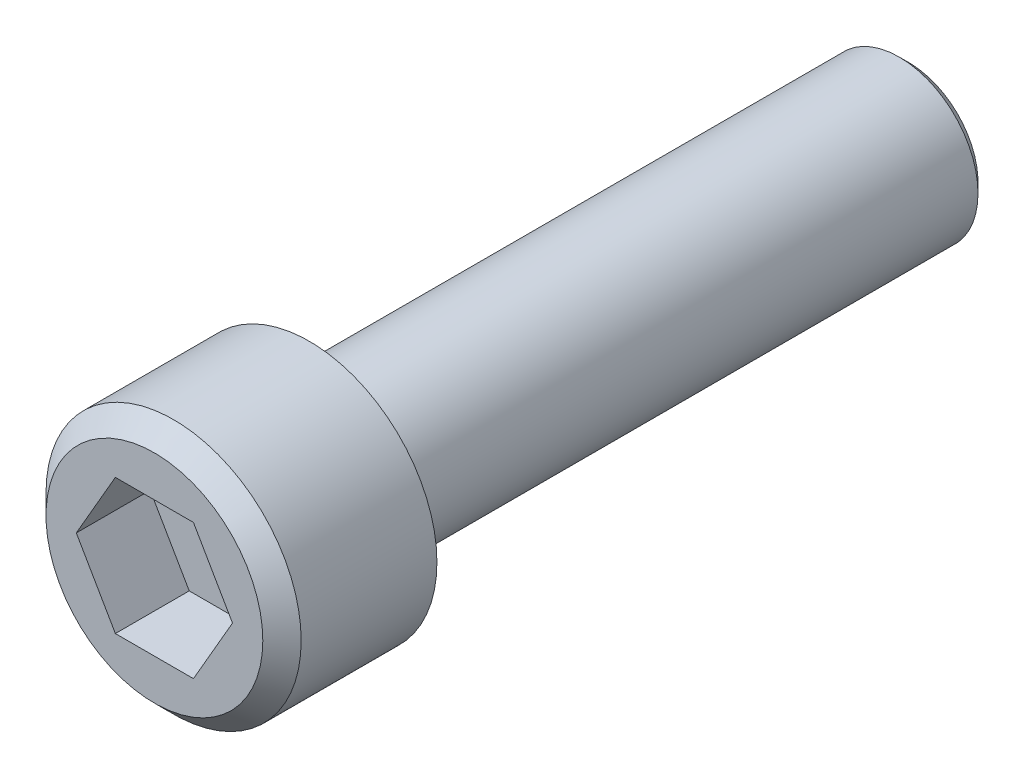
ISO-10303-21;
HEADER;
FILE_DESCRIPTION(('STEP AP214'),'2;1');
FILE_NAME('part.step','',(''),(''),'','','');
FILE_SCHEMA(('AUTOMOTIVE_DESIGN { 1 0 10303 214 1 1 1 1 }'));
ENDSEC;
DATA;
#1=APPLICATION_CONTEXT('core data for automotive mechanical design processes');
#2=APPLICATION_PROTOCOL_DEFINITION('international standard','automotive_design',2000,#1);
#3=PRODUCT_CONTEXT('',#1,'mechanical');
#4=PRODUCT('Part','Part','',(#3));
#5=PRODUCT_RELATED_PRODUCT_CATEGORY('part','',(#4));
#6=PRODUCT_DEFINITION_FORMATION('','',#4);
#7=PRODUCT_DEFINITION_CONTEXT('part definition',#1,'design');
#8=PRODUCT_DEFINITION('design','',#6,#7);
#9=PRODUCT_DEFINITION_SHAPE('','',#8);
#10=(LENGTH_UNIT() NAMED_UNIT(*) SI_UNIT(.MILLI.,.METRE.));
#11=(NAMED_UNIT(*) PLANE_ANGLE_UNIT() SI_UNIT($,.RADIAN.));
#12=(NAMED_UNIT(*) SI_UNIT($,.STERADIAN.) SOLID_ANGLE_UNIT());
#13=UNCERTAINTY_MEASURE_WITH_UNIT(LENGTH_MEASURE(1.E-05),#10,'distance_accuracy_value','');
#14=(GEOMETRIC_REPRESENTATION_CONTEXT(3) GLOBAL_UNCERTAINTY_ASSIGNED_CONTEXT((#13)) GLOBAL_UNIT_ASSIGNED_CONTEXT((#10,
#11,#12)) REPRESENTATION_CONTEXT('',''));
#15=CARTESIAN_POINT('',(0.,0.,0.));
#16=DIRECTION('',(0.,0.,1.));
#17=DIRECTION('',(1.,0.,0.));
#18=AXIS2_PLACEMENT_3D('',#15,#16,#17);
#19=CARTESIAN_POINT('',(8.88178419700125E-13,0.,-4.102099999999));
#20=DIRECTION('',(0.,0.,1.));
#21=DIRECTION('',(1.,0.,0.));
#22=AXIS2_PLACEMENT_3D('',#19,#20,#21);
#23=PLANE('',#22);
#24=CARTESIAN_POINT('',(8.88178419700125E-13,0.,-4.102099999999));
#25=DIRECTION('',(0.,0.,1.));
#26=DIRECTION('',(1.,0.,0.));
#27=AXIS2_PLACEMENT_3D('',#24,#25,#26);
#28=CIRCLE('',#27,3.3782);
#29=CARTESIAN_POINT('',(3.37820000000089,0.,-4.102099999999));
#30=VERTEX_POINT('',#29);
#31=EDGE_CURVE('E142',#30,#30,#28,.T.);
#32=ORIENTED_EDGE('',*,*,#31,.F.);
#33=EDGE_LOOP('',(#32));
#34=FACE_BOUND('',#33,.T.);
#35=CARTESIAN_POINT('',(8.88178419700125E-13,0.,-4.102099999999));
#36=DIRECTION('',(0.,0.,1.));
#37=DIRECTION('',(1.,0.,0.));
#38=AXIS2_PLACEMENT_3D('',#35,#36,#37);
#39=CIRCLE('',#38,2.0828);
#40=CARTESIAN_POINT('',(2.08280000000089,0.,-4.102099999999));
#41=VERTEX_POINT('',#40);
#42=EDGE_CURVE('E150',#41,#41,#39,.F.);
#43=ORIENTED_EDGE('',*,*,#42,.F.);
#44=EDGE_LOOP('',(#43));
#45=FACE_BOUND('',#44,.T.);
#46=ADVANCED_FACE('F40',(#34,#45),#23,.F.);
#47=CARTESIAN_POINT('',(8.88178419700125E-13,0.,-4.102099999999));
#48=DIRECTION('',(0.,0.,1.));
#49=DIRECTION('',(1.,0.,0.));
#50=AXIS2_PLACEMENT_3D('',#47,#48,#49);
#51=CYLINDRICAL_SURFACE('',#50,3.3782);
#52=CARTESIAN_POINT('',(1.77635683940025E-12,0.,-0.507999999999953));
#53=DIRECTION('',(0.,0.,1.));
#54=DIRECTION('',(1.,0.,0.));
#55=AXIS2_PLACEMENT_3D('',#52,#53,#54);
#56=CIRCLE('',#55,3.3782);
#57=CARTESIAN_POINT('',(3.37820000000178,0.,-0.507999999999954));
#58=VERTEX_POINT('',#57);
#59=EDGE_CURVE('E11',#58,#58,#56,.F.);
#60=ORIENTED_EDGE('',*,*,#59,.T.);
#61=EDGE_LOOP('',(#60));
#62=FACE_BOUND('',#61,.T.);
#63=ORIENTED_EDGE('',*,*,#31,.T.);
#64=EDGE_LOOP('',(#63));
#65=FACE_BOUND('',#64,.T.);
#66=ADVANCED_FACE('F173',(#62,#65),#51,.T.);
#67=CARTESIAN_POINT('',(0.,0.,0.));
#68=DIRECTION('',(0.,0.,1.));
#69=DIRECTION('',(1.,0.,0.));
#70=AXIS2_PLACEMENT_3D('',#67,#68,#69);
#71=PLANE('',#70);
#72=CARTESIAN_POINT('',(0.,0.,0.));
#73=DIRECTION('',(0.,0.,1.));
#74=DIRECTION('',(1.,0.,0.));
#75=AXIS2_PLACEMENT_3D('',#72,#73,#74);
#76=CIRCLE('',#75,2.8702);
#77=CARTESIAN_POINT('',(2.8702,0.,0.));
#78=VERTEX_POINT('',#77);
#79=EDGE_CURVE('E48',#78,#78,#76,.T.);
#80=ORIENTED_EDGE('',*,*,#79,.T.);
#81=EDGE_LOOP('',(#80));
#82=FACE_BOUND('',#81,.T.);
#83=DIRECTION('',(0.5,0.866025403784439,0.));
#84=VECTOR('',#83,1.);
#85=CARTESIAN_POINT('',(1.03386112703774,-1.79070000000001,0.));
#86=LINE('',#85,#84);
#87=CARTESIAN_POINT('',(1.03386112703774,-1.79070000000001,0.));
#88=VERTEX_POINT('',#87);
#89=CARTESIAN_POINT('',(2.06772225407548,0.,0.));
#90=VERTEX_POINT('',#89);
#91=EDGE_CURVE('E55',#88,#90,#86,.T.);
#92=ORIENTED_EDGE('',*,*,#91,.F.);
#93=DIRECTION('',(1.,0.,0.));
#94=VECTOR('',#93,1.);
#95=CARTESIAN_POINT('',(-1.03386112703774,-1.79070000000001,0.));
#96=LINE('',#95,#94);
#97=CARTESIAN_POINT('',(-1.03386112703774,-1.79070000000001,0.));
#98=VERTEX_POINT('',#97);
#99=EDGE_CURVE('E138',#98,#88,#96,.T.);
#100=ORIENTED_EDGE('',*,*,#99,.F.);
#101=DIRECTION('',(0.5,-0.866025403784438,0.));
#102=VECTOR('',#101,1.);
#103=CARTESIAN_POINT('',(-2.06772225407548,0.,-8.88178419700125E-13));
#104=LINE('',#103,#102);
#105=CARTESIAN_POINT('',(-2.06772225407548,0.,-8.88178419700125E-13));
#106=VERTEX_POINT('',#105);
#107=EDGE_CURVE('E136',#106,#98,#104,.T.);
#108=ORIENTED_EDGE('',*,*,#107,.F.);
#109=DIRECTION('',(-0.5,-0.866025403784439,0.));
#110=VECTOR('',#109,1.);
#111=CARTESIAN_POINT('',(-1.03386112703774,1.79070000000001,0.));
#112=LINE('',#111,#110);
#113=CARTESIAN_POINT('',(-1.03386112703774,1.79070000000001,0.));
#114=VERTEX_POINT('',#113);
#115=EDGE_CURVE('E103',#114,#106,#112,.T.);
#116=ORIENTED_EDGE('',*,*,#115,.F.);
#117=DIRECTION('',(-1.,0.,0.));
#118=VECTOR('',#117,1.);
#119=CARTESIAN_POINT('',(1.03386112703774,1.79070000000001,0.));
#120=LINE('',#119,#118);
#121=CARTESIAN_POINT('',(1.03386112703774,1.79070000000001,0.));
#122=VERTEX_POINT('',#121);
#123=EDGE_CURVE('E132',#122,#114,#120,.T.);
#124=ORIENTED_EDGE('',*,*,#123,.F.);
#125=DIRECTION('',(-0.5,0.866025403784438,0.));
#126=VECTOR('',#125,1.);
#127=CARTESIAN_POINT('',(2.06772225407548,0.,0.));
#128=LINE('',#127,#126);
#129=EDGE_CURVE('E129',#90,#122,#128,.T.);
#130=ORIENTED_EDGE('',*,*,#129,.F.);
#131=EDGE_LOOP('',(#92,#100,#108,#116,#124,#130));
#132=FACE_BOUND('',#131,.T.);
#133=ADVANCED_FACE('F161',(#82,#132),#71,.T.);
#134=CARTESIAN_POINT('',(1.77635683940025E-12,-1.66533453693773E-13,-19.9770999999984));
#135=DIRECTION('',(0.,0.,1.));
#136=DIRECTION('',(1.,0.,0.));
#137=AXIS2_PLACEMENT_3D('',#134,#135,#136);
#138=CYLINDRICAL_SURFACE('',#137,2.0828);
#139=CARTESIAN_POINT('',(0.,-1.38777878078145E-13,-19.7231000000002));
#140=DIRECTION('',(0.,0.,-1.));
#141=DIRECTION('',(-1.,0.,0.));
#142=AXIS2_PLACEMENT_3D('',#139,#140,#141);
#143=CIRCLE('',#142,2.0828);
#144=CARTESIAN_POINT('',(-2.0828,-1.38819051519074E-13,-19.7231000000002));
#145=VERTEX_POINT('',#144);
#146=EDGE_CURVE('E156',#145,#145,#143,.F.);
#147=ORIENTED_EDGE('',*,*,#146,.T.);
#148=EDGE_LOOP('',(#147));
#149=FACE_BOUND('',#148,.T.);
#150=ORIENTED_EDGE('',*,*,#42,.T.);
#151=EDGE_LOOP('',(#150));
#152=FACE_BOUND('',#151,.T.);
#153=ADVANCED_FACE('F185',(#149,#152),#138,.T.);
#154=CARTESIAN_POINT('',(1.77635683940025E-12,-1.66533453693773E-13,-19.9770999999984));
#155=DIRECTION('',(0.,0.,-1.));
#156=DIRECTION('',(-1.,0.,0.));
#157=AXIS2_PLACEMENT_3D('',#154,#155,#156);
#158=PLANE('',#157);
#159=CARTESIAN_POINT('',(1.77635683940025E-12,-1.66533453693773E-13,-19.9770999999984));
#160=DIRECTION('',(0.,0.,-1.));
#161=DIRECTION('',(-1.,0.,0.));
#162=AXIS2_PLACEMENT_3D('',#159,#160,#161);
#163=CIRCLE('',#162,1.8288);
#164=CARTESIAN_POINT('',(-1.82879999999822,-1.6656960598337E-13,-19.9770999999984));
#165=VERTEX_POINT('',#164);
#166=EDGE_CURVE('E153',#165,#165,#163,.T.);
#167=ORIENTED_EDGE('',*,*,#166,.T.);
#168=EDGE_LOOP('',(#167));
#169=FACE_BOUND('',#168,.T.);
#170=ADVANCED_FACE('F191',(#169),#158,.T.);
#171=CARTESIAN_POINT('',(1.03386112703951,-1.79070000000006,-1.9557999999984));
#172=DIRECTION('',(0.866025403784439,-0.5,0.));
#173=DIRECTION('',(0.5,0.866025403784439,0.));
#174=AXIS2_PLACEMENT_3D('',#171,#172,#173);
#175=PLANE('',#174);
#176=ORIENTED_EDGE('',*,*,#91,.T.);
#177=DIRECTION('',(0.,0.,1.));
#178=VECTOR('',#177,1.);
#179=CARTESIAN_POINT('',(2.06772225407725,0.,-1.95580000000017));
#180=LINE('',#179,#178);
#181=CARTESIAN_POINT('',(2.06772225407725,0.,-1.95580000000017));
#182=VERTEX_POINT('',#181);
#183=EDGE_CURVE('E85',#182,#90,#180,.T.);
#184=ORIENTED_EDGE('',*,*,#183,.F.);
#185=DIRECTION('',(0.5,0.866025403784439,0.));
#186=VECTOR('',#185,1.);
#187=CARTESIAN_POINT('',(1.03386112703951,-1.79070000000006,-1.9557999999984));
#188=LINE('',#187,#186);
#189=CARTESIAN_POINT('',(1.03386112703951,-1.79070000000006,-1.9557999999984));
#190=VERTEX_POINT('',#189);
#191=EDGE_CURVE('E140',#190,#182,#188,.T.);
#192=ORIENTED_EDGE('',*,*,#191,.F.);
#193=DIRECTION('',(0.,0.,1.));
#194=VECTOR('',#193,1.);
#195=CARTESIAN_POINT('',(1.03386112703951,-1.79070000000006,-1.9557999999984));
#196=LINE('',#195,#194);
#197=EDGE_CURVE('E63',#190,#88,#196,.T.);
#198=ORIENTED_EDGE('',*,*,#197,.T.);
#199=EDGE_LOOP('',(#176,#184,#192,#198));
#200=FACE_BOUND('',#199,.T.);
#201=ADVANCED_FACE('F196',(#200),#175,.F.);
#202=CARTESIAN_POINT('',(-1.03386112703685,-1.79070000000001,-1.95580000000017));
#203=DIRECTION('',(0.,-1.,0.));
#204=DIRECTION('',(1.,0.,0.));
#205=AXIS2_PLACEMENT_3D('',#202,#203,#204);
#206=PLANE('',#205);
#207=ORIENTED_EDGE('',*,*,#99,.T.);
#208=ORIENTED_EDGE('',*,*,#197,.F.);
#209=DIRECTION('',(1.,0.,0.));
#210=VECTOR('',#209,1.);
#211=CARTESIAN_POINT('',(-1.03386112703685,-1.79070000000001,-1.95580000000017));
#212=LINE('',#211,#210);
#213=CARTESIAN_POINT('',(-1.03386112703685,-1.79070000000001,-1.95580000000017));
#214=VERTEX_POINT('',#213);
#215=EDGE_CURVE('E115',#214,#190,#212,.T.);
#216=ORIENTED_EDGE('',*,*,#215,.F.);
#217=DIRECTION('',(0.,0.,1.));
#218=VECTOR('',#217,1.);
#219=CARTESIAN_POINT('',(-1.03386112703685,-1.79070000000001,-1.95580000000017));
#220=LINE('',#219,#218);
#221=EDGE_CURVE('E107',#214,#98,#220,.T.);
#222=ORIENTED_EDGE('',*,*,#221,.T.);
#223=EDGE_LOOP('',(#207,#208,#216,#222));
#224=FACE_BOUND('',#223,.T.);
#225=ADVANCED_FACE('F206',(#224),#206,.F.);
#226=CARTESIAN_POINT('',(-2.06772225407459,0.,-1.95580000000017));
#227=DIRECTION('',(-0.866025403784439,-0.5,0.));
#228=DIRECTION('',(0.5,-0.866025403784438,0.));
#229=AXIS2_PLACEMENT_3D('',#226,#227,#228);
#230=PLANE('',#229);
#231=ORIENTED_EDGE('',*,*,#107,.T.);
#232=ORIENTED_EDGE('',*,*,#221,.F.);
#233=DIRECTION('',(0.5,-0.866025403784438,0.));
#234=VECTOR('',#233,1.);
#235=CARTESIAN_POINT('',(-2.06772225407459,0.,-1.95580000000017));
#236=LINE('',#235,#234);
#237=CARTESIAN_POINT('',(-2.06772225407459,0.,-1.95580000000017));
#238=VERTEX_POINT('',#237);
#239=EDGE_CURVE('E111',#238,#214,#236,.T.);
#240=ORIENTED_EDGE('',*,*,#239,.F.);
#241=DIRECTION('',(0.,0.,1.));
#242=VECTOR('',#241,1.);
#243=CARTESIAN_POINT('',(-2.06772225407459,0.,-1.95580000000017));
#244=LINE('',#243,#242);
#245=EDGE_CURVE('E96',#238,#106,#244,.T.);
#246=ORIENTED_EDGE('',*,*,#245,.T.);
#247=EDGE_LOOP('',(#231,#232,#240,#246));
#248=FACE_BOUND('',#247,.T.);
#249=ADVANCED_FACE('F112',(#248),#230,.F.);
#250=CARTESIAN_POINT('',(-1.03386112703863,1.79070000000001,-1.95580000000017));
#251=DIRECTION('',(-0.866025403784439,0.5,0.));
#252=DIRECTION('',(-0.5,-0.866025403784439,0.));
#253=AXIS2_PLACEMENT_3D('',#250,#251,#252);
#254=PLANE('',#253);
#255=ORIENTED_EDGE('',*,*,#115,.T.);
#256=ORIENTED_EDGE('',*,*,#245,.F.);
#257=DIRECTION('',(-0.5,-0.866025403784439,0.));
#258=VECTOR('',#257,1.);
#259=CARTESIAN_POINT('',(-1.03386112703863,1.79070000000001,-1.95580000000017));
#260=LINE('',#259,#258);
#261=CARTESIAN_POINT('',(-1.03386112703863,1.79070000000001,-1.95580000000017));
#262=VERTEX_POINT('',#261);
#263=EDGE_CURVE('E100',#262,#238,#260,.T.);
#264=ORIENTED_EDGE('',*,*,#263,.F.);
#265=DIRECTION('',(0.,0.,1.));
#266=VECTOR('',#265,1.);
#267=CARTESIAN_POINT('',(-1.03386112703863,1.79070000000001,-1.95580000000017));
#268=LINE('',#267,#266);
#269=EDGE_CURVE('E108',#262,#114,#268,.T.);
#270=ORIENTED_EDGE('',*,*,#269,.T.);
#271=EDGE_LOOP('',(#255,#256,#264,#270));
#272=FACE_BOUND('',#271,.T.);
#273=ADVANCED_FACE('F98',(#272),#254,.F.);
#274=CARTESIAN_POINT('',(1.03386112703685,1.79069999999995,-1.95580000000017));
#275=DIRECTION('',(0.,1.,0.));
#276=DIRECTION('',(0.,0.,1.));
#277=AXIS2_PLACEMENT_3D('',#274,#275,#276);
#278=PLANE('',#277);
#279=ORIENTED_EDGE('',*,*,#123,.T.);
#280=ORIENTED_EDGE('',*,*,#269,.F.);
#281=DIRECTION('',(-1.,0.,0.));
#282=VECTOR('',#281,1.);
#283=CARTESIAN_POINT('',(1.03386112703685,1.79069999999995,-1.95580000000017));
#284=LINE('',#283,#282);
#285=CARTESIAN_POINT('',(1.03386112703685,1.79069999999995,-1.95580000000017));
#286=VERTEX_POINT('',#285);
#287=EDGE_CURVE('E121',#286,#262,#284,.T.);
#288=ORIENTED_EDGE('',*,*,#287,.F.);
#289=DIRECTION('',(0.,0.,1.));
#290=VECTOR('',#289,1.);
#291=CARTESIAN_POINT('',(1.03386112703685,1.79069999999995,-1.95580000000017));
#292=LINE('',#291,#290);
#293=EDGE_CURVE('E145',#286,#122,#292,.T.);
#294=ORIENTED_EDGE('',*,*,#293,.T.);
#295=EDGE_LOOP('',(#279,#280,#288,#294));
#296=FACE_BOUND('',#295,.T.);
#297=ADVANCED_FACE('F212',(#296),#278,.F.);
#298=CARTESIAN_POINT('',(2.06772225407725,0.,-1.95580000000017));
#299=DIRECTION('',(0.866025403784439,0.5,0.));
#300=DIRECTION('',(-0.5,0.866025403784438,0.));
#301=AXIS2_PLACEMENT_3D('',#298,#299,#300);
#302=PLANE('',#301);
#303=ORIENTED_EDGE('',*,*,#129,.T.);
#304=ORIENTED_EDGE('',*,*,#293,.F.);
#305=DIRECTION('',(-0.5,0.866025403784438,0.));
#306=VECTOR('',#305,1.);
#307=CARTESIAN_POINT('',(2.06772225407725,0.,-1.95580000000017));
#308=LINE('',#307,#306);
#309=EDGE_CURVE('E123',#182,#286,#308,.T.);
#310=ORIENTED_EDGE('',*,*,#309,.F.);
#311=ORIENTED_EDGE('',*,*,#183,.T.);
#312=EDGE_LOOP('',(#303,#304,#310,#311));
#313=FACE_BOUND('',#312,.T.);
#314=ADVANCED_FACE('F209',(#313),#302,.F.);
#315=CARTESIAN_POINT('',(1.03386112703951,-1.79070000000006,-1.9557999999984));
#316=DIRECTION('',(0.,0.,-1.));
#317=DIRECTION('',(-1.,0.,0.));
#318=AXIS2_PLACEMENT_3D('',#315,#316,#317);
#319=PLANE('',#318);
#320=ORIENTED_EDGE('',*,*,#191,.T.);
#321=ORIENTED_EDGE('',*,*,#309,.T.);
#322=ORIENTED_EDGE('',*,*,#287,.T.);
#323=ORIENTED_EDGE('',*,*,#263,.T.);
#324=ORIENTED_EDGE('',*,*,#239,.T.);
#325=ORIENTED_EDGE('',*,*,#215,.T.);
#326=EDGE_LOOP('',(#320,#321,#322,#323,#324,#325));
#327=FACE_BOUND('',#326,.T.);
#328=ADVANCED_FACE('F118',(#327),#319,.F.);
#329=CARTESIAN_POINT('',(1.77635683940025E-12,-1.66533453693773E-13,-19.9770999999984));
#330=DIRECTION('',(0.,0.,1.));
#331=DIRECTION('',(1.,0.,0.));
#332=AXIS2_PLACEMENT_3D('',#329,#330,#331);
#333=CONICAL_SURFACE('',#332,1.8288,0.785398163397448);
#334=ORIENTED_EDGE('',*,*,#146,.F.);
#335=EDGE_LOOP('',(#334));
#336=FACE_BOUND('',#335,.T.);
#337=ORIENTED_EDGE('',*,*,#166,.F.);
#338=EDGE_LOOP('',(#337));
#339=FACE_BOUND('',#338,.T.);
#340=ADVANCED_FACE('F165',(#336,#339),#333,.T.);
#341=CARTESIAN_POINT('',(0.,0.,0.));
#342=DIRECTION('',(0.,0.,-1.));
#343=DIRECTION('',(-1.,0.,0.));
#344=AXIS2_PLACEMENT_3D('',#341,#342,#343);
#345=CONICAL_SURFACE('',#344,2.8702,0.785398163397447);
#346=ORIENTED_EDGE('',*,*,#59,.F.);
#347=EDGE_LOOP('',(#346));
#348=FACE_BOUND('',#347,.T.);
#349=ORIENTED_EDGE('',*,*,#79,.F.);
#350=EDGE_LOOP('',(#349));
#351=FACE_BOUND('',#350,.T.);
#352=ADVANCED_FACE('F42',(#348,#351),#345,.T.);
#353=CLOSED_SHELL('',(#46,#66,#133,#153,#170,#201,#225,#249,#273,#297,#314,#328,#340,#352));
#354=MANIFOLD_SOLID_BREP('B2',#353);
#355=ADVANCED_BREP_SHAPE_REPRESENTATION('',(#18,#354),#14);
#356=SHAPE_DEFINITION_REPRESENTATION(#9,#355);
ENDSEC;
END-ISO-10303-21;
